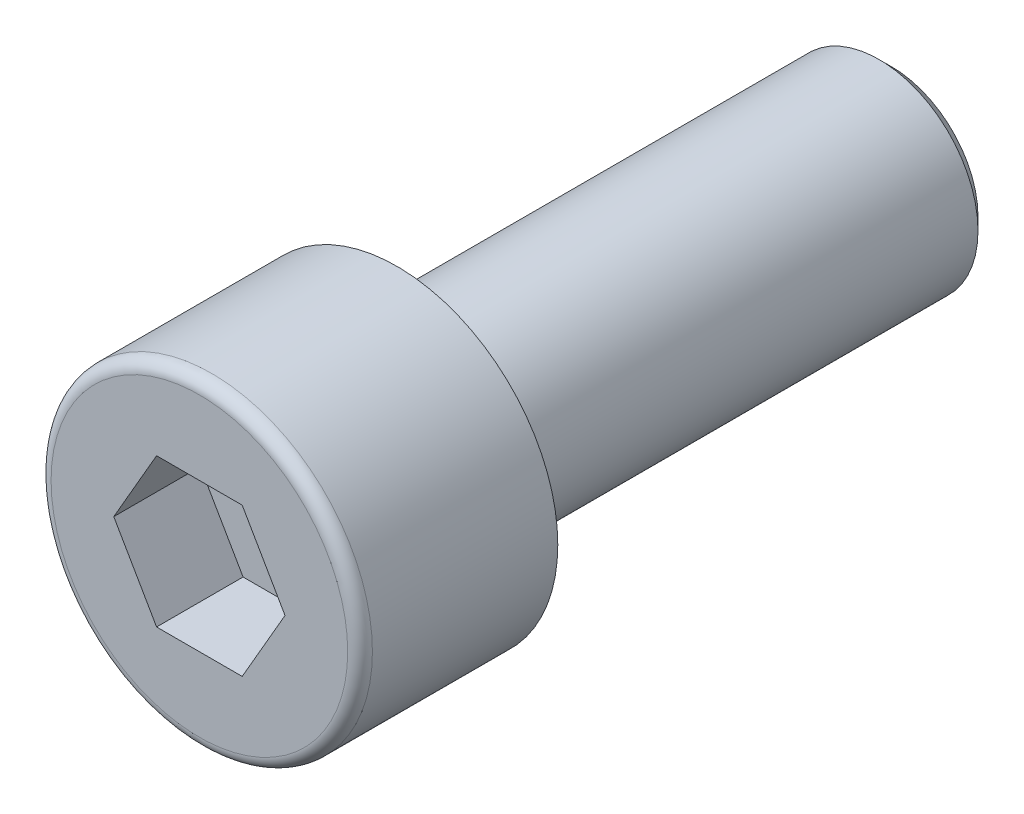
from build123d import *

# Parameters (mm, degrees)
ESQUISSE1_R             = 4
BASE_EXTRUSION_DEPTH    = 20
ESQUISSE2_R             = 6.5
BOSS_EXTRU_1_DEPTH      = 8
ENL_V_MAT_EXTRU_1_DEPTH = 3.5
CONG_2_R                = 0.5
CHANFREIN1_SIZE         = 0.5


with BuildPart() as part:
    # Esquisse1 → Base-Extrusion (new body)
    with BuildSketch(Plane.XY):
        Circle(ESQUISSE1_R)
    extrude(amount=BASE_EXTRUSION_DEPTH)

    # Esquisse2 → Boss.-Extru.1 (add)
    with BuildSketch(Plane.XY.offset(20)):
        Circle(ESQUISSE2_R)
    extrude(amount=BOSS_EXTRU_1_DEPTH)

    # Esquisse3 → Enl_v. mat.-Extru.1 (cut)
    with BuildSketch(Plane.XY.offset(28)):
        Polygon((-1.732050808, 3), (1.732050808, 3), (3.464101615, 0), (1.732050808, -3), (-1.732050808, -3), (-3.464101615, 0), align=None)
    extrude(amount=-ENL_V_MAT_EXTRU_1_DEPTH, mode=Mode.SUBTRACT)

    # Cong_2
    cong_2_edges = [part.edges().sort_by_distance(p)[0] for p in [
        (-6.5, 0, 28),
    ]]
    fillet(cong_2_edges, radius=CONG_2_R)

    # Chanfrein1
    chanfrein1_edges = [part.edges().sort_by_distance(p)[0] for p in [
        (-4, 0, 0),
    ]]
    chamfer(chanfrein1_edges, length=CHANFREIN1_SIZE)


solid = part.part
